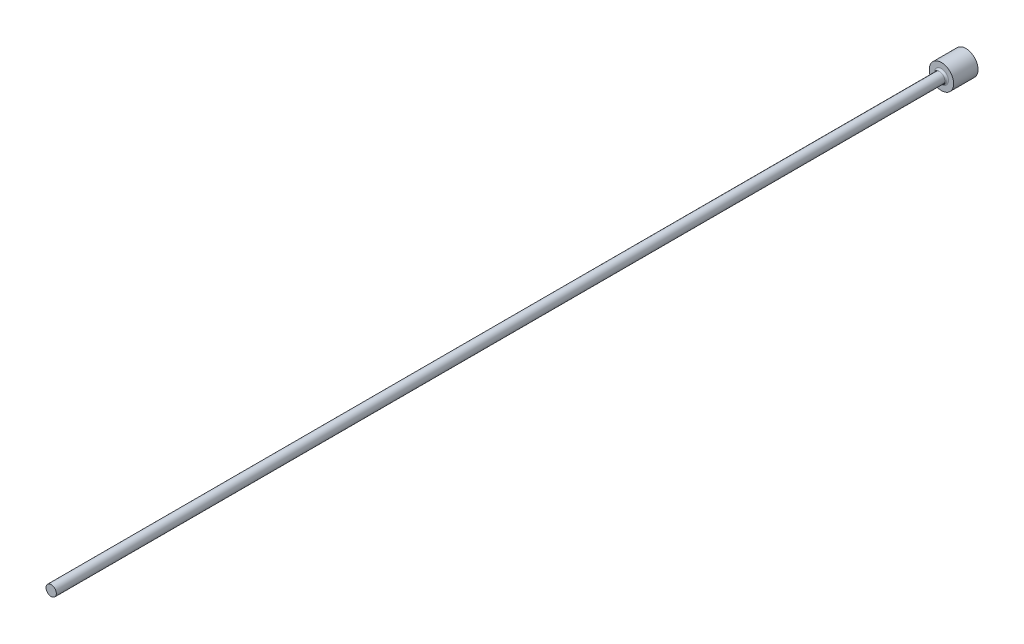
from build123d import *

# Parameters (mm, degrees)
FILLET1_R = 0.3


with BuildPart() as part:
    # FV → Revolve1 (revolve)
    with BuildSketch(Plane(origin=(0, 0, 0), x_dir=(1, 0, 0), z_dir=(0, 1, 0)), mode=Mode.PRIVATE) as revolve1_sk:
        Polygon((0, 0), (2, 0), (2, -4), (0.85, -4), (0.85, -150), (0, -150), align=None)
    revolve(revolve1_sk.sketch.rotate(Axis((0, 0, -9.033228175), (0, 0, 1)), 180), axis=Axis((0, 0, -9.033228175), (0, 0, 1)))

    # Fillet1
    fillet1_edges = [part.edges().sort_by_distance(p)[0] for p in [
        (0.85, 0, 4),
    ]]
    fillet(fillet1_edges, radius=FILLET1_R)


solid = part.part
